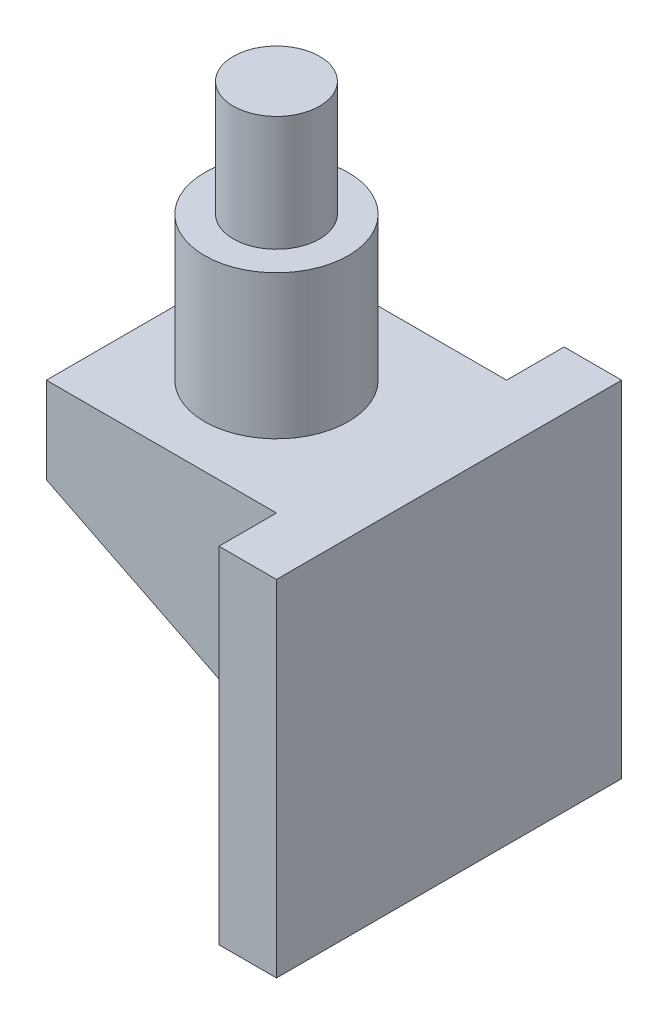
ISO-10303-21;
HEADER;
FILE_DESCRIPTION(('STEP AP214'),'2;1');
FILE_NAME('part.step','',(''),(''),'','','');
FILE_SCHEMA(('AUTOMOTIVE_DESIGN { 1 0 10303 214 1 1 1 1 }'));
ENDSEC;
DATA;
#1=APPLICATION_CONTEXT('core data for automotive mechanical design processes');
#2=APPLICATION_PROTOCOL_DEFINITION('international standard','automotive_design',2000,#1);
#3=PRODUCT_CONTEXT('',#1,'mechanical');
#4=PRODUCT('Part','Part','',(#3));
#5=PRODUCT_RELATED_PRODUCT_CATEGORY('part','',(#4));
#6=PRODUCT_DEFINITION_FORMATION('','',#4);
#7=PRODUCT_DEFINITION_CONTEXT('part definition',#1,'design');
#8=PRODUCT_DEFINITION('design','',#6,#7);
#9=PRODUCT_DEFINITION_SHAPE('','',#8);
#10=(LENGTH_UNIT() NAMED_UNIT(*) SI_UNIT(.MILLI.,.METRE.));
#11=(NAMED_UNIT(*) PLANE_ANGLE_UNIT() SI_UNIT($,.RADIAN.));
#12=(NAMED_UNIT(*) SI_UNIT($,.STERADIAN.) SOLID_ANGLE_UNIT());
#13=UNCERTAINTY_MEASURE_WITH_UNIT(LENGTH_MEASURE(1.E-05),#10,'distance_accuracy_value','');
#14=(GEOMETRIC_REPRESENTATION_CONTEXT(3) GLOBAL_UNCERTAINTY_ASSIGNED_CONTEXT((#13)) GLOBAL_UNIT_ASSIGNED_CONTEXT((#10,
#11,#12)) REPRESENTATION_CONTEXT('',''));
#15=CARTESIAN_POINT('',(0.,0.,0.));
#16=DIRECTION('',(0.,0.,1.));
#17=DIRECTION('',(1.,0.,0.));
#18=AXIS2_PLACEMENT_3D('',#15,#16,#17);
#19=CARTESIAN_POINT('',(-20.,105.,0.));
#20=DIRECTION('',(0.,-1.,0.));
#21=DIRECTION('',(0.,0.,-1.));
#22=AXIS2_PLACEMENT_3D('',#19,#20,#21);
#23=CYLINDRICAL_SURFACE('',#22,7.5);
#24=CARTESIAN_POINT('',(-20.,105.,0.));
#25=DIRECTION('',(0.,1.,0.));
#26=DIRECTION('',(0.,0.,1.));
#27=AXIS2_PLACEMENT_3D('',#24,#25,#26);
#28=CIRCLE('',#27,7.5);
#29=CARTESIAN_POINT('',(-20.,105.,7.5));
#30=VERTEX_POINT('',#29);
#31=EDGE_CURVE('E311',#30,#30,#28,.T.);
#32=ORIENTED_EDGE('',*,*,#31,.F.);
#33=EDGE_LOOP('',(#32));
#34=FACE_BOUND('',#33,.T.);
#35=CARTESIAN_POINT('',(-20.,85.,0.));
#36=DIRECTION('',(0.,1.,0.));
#37=DIRECTION('',(0.,0.,1.));
#38=AXIS2_PLACEMENT_3D('',#35,#36,#37);
#39=CIRCLE('',#38,7.5);
#40=CARTESIAN_POINT('',(-20.,85.,7.5));
#41=VERTEX_POINT('',#40);
#42=EDGE_CURVE('E9',#41,#41,#39,.T.);
#43=ORIENTED_EDGE('',*,*,#42,.T.);
#44=EDGE_LOOP('',(#43));
#45=FACE_BOUND('',#44,.T.);
#46=ADVANCED_FACE('F14',(#34,#45),#23,.T.);
#47=CARTESIAN_POINT('',(-20.,105.,0.));
#48=DIRECTION('',(0.,1.,0.));
#49=DIRECTION('',(0.,0.,1.));
#50=AXIS2_PLACEMENT_3D('',#47,#48,#49);
#51=PLANE('',#50);
#52=ORIENTED_EDGE('',*,*,#31,.T.);
#53=EDGE_LOOP('',(#52));
#54=FACE_BOUND('',#53,.T.);
#55=ADVANCED_FACE('F182',(#54),#51,.T.);
#56=CARTESIAN_POINT('',(-20.,85.,0.));
#57=DIRECTION('',(0.,-1.,0.));
#58=DIRECTION('',(0.,0.,-1.));
#59=AXIS2_PLACEMENT_3D('',#56,#57,#58);
#60=CYLINDRICAL_SURFACE('',#59,12.5);
#61=CARTESIAN_POINT('',(-20.,85.,0.));
#62=DIRECTION('',(0.,1.,0.));
#63=DIRECTION('',(0.,0.,1.));
#64=AXIS2_PLACEMENT_3D('',#61,#62,#63);
#65=CIRCLE('',#64,12.5);
#66=CARTESIAN_POINT('',(-20.,85.,12.5));
#67=VERTEX_POINT('',#66);
#68=EDGE_CURVE('E95',#67,#67,#65,.T.);
#69=ORIENTED_EDGE('',*,*,#68,.F.);
#70=EDGE_LOOP('',(#69));
#71=FACE_BOUND('',#70,.T.);
#72=CARTESIAN_POINT('',(-20.,60.0000000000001,0.));
#73=DIRECTION('',(0.,1.,0.));
#74=DIRECTION('',(0.,0.,1.));
#75=AXIS2_PLACEMENT_3D('',#72,#73,#74);
#76=CIRCLE('',#75,12.5);
#77=CARTESIAN_POINT('',(-20.,60.0000000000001,12.5));
#78=VERTEX_POINT('',#77);
#79=EDGE_CURVE('E23',#78,#78,#76,.T.);
#80=ORIENTED_EDGE('',*,*,#79,.T.);
#81=EDGE_LOOP('',(#80));
#82=FACE_BOUND('',#81,.T.);
#83=ADVANCED_FACE('F184',(#71,#82),#60,.T.);
#84=CARTESIAN_POINT('',(-20.,85.,0.));
#85=DIRECTION('',(0.,1.,0.));
#86=DIRECTION('',(0.,0.,1.));
#87=AXIS2_PLACEMENT_3D('',#84,#85,#86);
#88=PLANE('',#87);
#89=ORIENTED_EDGE('',*,*,#42,.F.);
#90=EDGE_LOOP('',(#89));
#91=FACE_BOUND('',#90,.T.);
#92=ORIENTED_EDGE('',*,*,#68,.T.);
#93=EDGE_LOOP('',(#92));
#94=FACE_BOUND('',#93,.T.);
#95=ADVANCED_FACE('F191',(#91,#94),#88,.T.);
#96=CARTESIAN_POINT('',(10.,60.0000000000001,29.9999999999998));
#97=DIRECTION('',(0.,-1.,0.));
#98=DIRECTION('',(0.,0.,-1.));
#99=AXIS2_PLACEMENT_3D('',#96,#97,#98);
#100=PLANE('',#99);
#101=DIRECTION('',(-1.,0.,0.));
#102=VECTOR('',#101,1.);
#103=CARTESIAN_POINT('',(10.,60.0000000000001,29.9999999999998));
#104=LINE('',#103,#102);
#105=CARTESIAN_POINT('',(10.,60.0000000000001,29.9999999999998));
#106=VERTEX_POINT('',#105);
#107=CARTESIAN_POINT('',(0.,60.0000000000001,29.9999999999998));
#108=VERTEX_POINT('',#107);
#109=EDGE_CURVE('E137',#106,#108,#104,.T.);
#110=ORIENTED_EDGE('',*,*,#109,.F.);
#111=DIRECTION('',(0.,0.,-1.));
#112=VECTOR('',#111,1.);
#113=CARTESIAN_POINT('',(10.,60.0000000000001,29.9999999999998));
#114=LINE('',#113,#112);
#115=CARTESIAN_POINT('',(10.,60.0000000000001,-29.9999999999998));
#116=VERTEX_POINT('',#115);
#117=EDGE_CURVE('E149',#106,#116,#114,.T.);
#118=ORIENTED_EDGE('',*,*,#117,.T.);
#119=DIRECTION('',(-1.,0.,0.));
#120=VECTOR('',#119,1.);
#121=CARTESIAN_POINT('',(10.,60.0000000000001,-29.9999999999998));
#122=LINE('',#121,#120);
#123=CARTESIAN_POINT('',(0.,60.0000000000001,-29.9999999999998));
#124=VERTEX_POINT('',#123);
#125=EDGE_CURVE('E125',#116,#124,#122,.T.);
#126=ORIENTED_EDGE('',*,*,#125,.T.);
#127=DIRECTION('',(0.,0.,-1.));
#128=VECTOR('',#127,1.);
#129=CARTESIAN_POINT('',(0.,60.0000000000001,29.9999999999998));
#130=LINE('',#129,#128);
#131=CARTESIAN_POINT('',(0.,60.0000000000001,-20.));
#132=VERTEX_POINT('',#131);
#133=EDGE_CURVE('E146',#132,#124,#130,.T.);
#134=ORIENTED_EDGE('',*,*,#133,.F.);
#135=DIRECTION('',(-1.,0.,0.));
#136=VECTOR('',#135,1.);
#137=CARTESIAN_POINT('',(0.,60.0000000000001,-20.));
#138=LINE('',#137,#136);
#139=CARTESIAN_POINT('',(-39.9999999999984,60.0000000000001,-20.));
#140=VERTEX_POINT('',#139);
#141=EDGE_CURVE('E94',#132,#140,#138,.T.);
#142=ORIENTED_EDGE('',*,*,#141,.T.);
#143=DIRECTION('',(0.,0.,-1.));
#144=VECTOR('',#143,1.);
#145=CARTESIAN_POINT('',(-40.,60.0000000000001,20.));
#146=LINE('',#145,#144);
#147=CARTESIAN_POINT('',(-40.,60.0000000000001,20.));
#148=VERTEX_POINT('',#147);
#149=EDGE_CURVE('E120',#148,#140,#146,.T.);
#150=ORIENTED_EDGE('',*,*,#149,.F.);
#151=DIRECTION('',(-1.,0.,0.));
#152=VECTOR('',#151,1.);
#153=CARTESIAN_POINT('',(0.,60.0000000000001,20.));
#154=LINE('',#153,#152);
#155=CARTESIAN_POINT('',(0.,60.0000000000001,20.));
#156=VERTEX_POINT('',#155);
#157=EDGE_CURVE('E84',#156,#148,#154,.T.);
#158=ORIENTED_EDGE('',*,*,#157,.F.);
#159=EDGE_CURVE('E154',#108,#156,#130,.T.);
#160=ORIENTED_EDGE('',*,*,#159,.F.);
#161=EDGE_LOOP('',(#110,#118,#126,#134,#142,#150,#158,#160));
#162=FACE_BOUND('',#161,.T.);
#163=ORIENTED_EDGE('',*,*,#79,.F.);
#164=EDGE_LOOP('',(#163));
#165=FACE_BOUND('',#164,.T.);
#166=ADVANCED_FACE('F163',(#162,#165),#100,.F.);
#167=CARTESIAN_POINT('',(0.,0.,29.9999999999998));
#168=DIRECTION('',(-1.,0.,0.));
#169=DIRECTION('',(0.,0.,1.));
#170=AXIS2_PLACEMENT_3D('',#167,#168,#169);
#171=PLANE('',#170);
#172=ORIENTED_EDGE('',*,*,#159,.T.);
#173=DIRECTION('',(0.,-1.,0.));
#174=VECTOR('',#173,1.);
#175=CARTESIAN_POINT('',(0.,60.0000000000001,20.));
#176=LINE('',#175,#174);
#177=CARTESIAN_POINT('',(0.,24.9999999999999,20.));
#178=VERTEX_POINT('',#177);
#179=EDGE_CURVE('E31',#156,#178,#176,.T.);
#180=ORIENTED_EDGE('',*,*,#179,.T.);
#181=DIRECTION('',(0.,0.,-1.));
#182=VECTOR('',#181,1.);
#183=CARTESIAN_POINT('',(0.,24.9999999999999,20.));
#184=LINE('',#183,#182);
#185=CARTESIAN_POINT('',(0.,24.9999999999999,-20.));
#186=VERTEX_POINT('',#185);
#187=EDGE_CURVE('E77',#178,#186,#184,.T.);
#188=ORIENTED_EDGE('',*,*,#187,.T.);
#189=DIRECTION('',(0.,-1.,0.));
#190=VECTOR('',#189,1.);
#191=CARTESIAN_POINT('',(0.,60.0000000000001,-20.));
#192=LINE('',#191,#190);
#193=EDGE_CURVE('E37',#132,#186,#192,.T.);
#194=ORIENTED_EDGE('',*,*,#193,.F.);
#195=ORIENTED_EDGE('',*,*,#133,.T.);
#196=DIRECTION('',(0.,1.,0.));
#197=VECTOR('',#196,1.);
#198=CARTESIAN_POINT('',(0.,0.,-29.9999999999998));
#199=LINE('',#198,#197);
#200=CARTESIAN_POINT('',(0.,0.,-29.9999999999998));
#201=VERTEX_POINT('',#200);
#202=EDGE_CURVE('E122',#201,#124,#199,.T.);
#203=ORIENTED_EDGE('',*,*,#202,.F.);
#204=DIRECTION('',(0.,0.,-1.));
#205=VECTOR('',#204,1.);
#206=CARTESIAN_POINT('',(0.,0.,29.9999999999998));
#207=LINE('',#206,#205);
#208=CARTESIAN_POINT('',(0.,0.,29.9999999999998));
#209=VERTEX_POINT('',#208);
#210=EDGE_CURVE('E156',#209,#201,#207,.T.);
#211=ORIENTED_EDGE('',*,*,#210,.F.);
#212=DIRECTION('',(0.,1.,0.));
#213=VECTOR('',#212,1.);
#214=CARTESIAN_POINT('',(0.,0.,29.9999999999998));
#215=LINE('',#214,#213);
#216=EDGE_CURVE('E134',#209,#108,#215,.T.);
#217=ORIENTED_EDGE('',*,*,#216,.T.);
#218=EDGE_LOOP('',(#172,#180,#188,#194,#195,#203,#211,#217));
#219=FACE_BOUND('',#218,.T.);
#220=ADVANCED_FACE('F78',(#219),#171,.T.);
#221=CARTESIAN_POINT('',(0.,0.,29.9999999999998));
#222=DIRECTION('',(0.,1.,0.));
#223=DIRECTION('',(0.,0.,1.));
#224=AXIS2_PLACEMENT_3D('',#221,#222,#223);
#225=PLANE('',#224);
#226=DIRECTION('',(0.,0.,-1.));
#227=VECTOR('',#226,1.);
#228=CARTESIAN_POINT('',(10.,0.,29.9999999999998));
#229=LINE('',#228,#227);
#230=CARTESIAN_POINT('',(10.,0.,29.9999999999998));
#231=VERTEX_POINT('',#230);
#232=CARTESIAN_POINT('',(9.99999999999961,0.,-29.9999999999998));
#233=VERTEX_POINT('',#232);
#234=EDGE_CURVE('E157',#231,#233,#229,.T.);
#235=ORIENTED_EDGE('',*,*,#234,.F.);
#236=DIRECTION('',(1.,0.,0.));
#237=VECTOR('',#236,1.);
#238=CARTESIAN_POINT('',(0.,0.,29.9999999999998));
#239=LINE('',#238,#237);
#240=EDGE_CURVE('E143',#209,#231,#239,.T.);
#241=ORIENTED_EDGE('',*,*,#240,.F.);
#242=ORIENTED_EDGE('',*,*,#210,.T.);
#243=DIRECTION('',(1.,0.,0.));
#244=VECTOR('',#243,1.);
#245=CARTESIAN_POINT('',(0.,0.,-29.9999999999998));
#246=LINE('',#245,#244);
#247=EDGE_CURVE('E131',#201,#233,#246,.T.);
#248=ORIENTED_EDGE('',*,*,#247,.T.);
#249=EDGE_LOOP('',(#235,#241,#242,#248));
#250=FACE_BOUND('',#249,.T.);
#251=ADVANCED_FACE('F16',(#250),#225,.F.);
#252=CARTESIAN_POINT('',(10.,60.0000000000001,29.9999999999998));
#253=DIRECTION('',(1.,0.,0.));
#254=DIRECTION('',(0.,1.,0.));
#255=AXIS2_PLACEMENT_3D('',#252,#253,#254);
#256=PLANE('',#255);
#257=ORIENTED_EDGE('',*,*,#117,.F.);
#258=DIRECTION('',(0.,-1.,0.));
#259=VECTOR('',#258,1.);
#260=CARTESIAN_POINT('',(10.,60.0000000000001,29.9999999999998));
#261=LINE('',#260,#259);
#262=EDGE_CURVE('E140',#106,#231,#261,.T.);
#263=ORIENTED_EDGE('',*,*,#262,.T.);
#264=ORIENTED_EDGE('',*,*,#234,.T.);
#265=DIRECTION('',(0.,-1.,0.));
#266=VECTOR('',#265,1.);
#267=CARTESIAN_POINT('',(10.,60.0000000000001,-29.9999999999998));
#268=LINE('',#267,#266);
#269=EDGE_CURVE('E128',#116,#233,#268,.T.);
#270=ORIENTED_EDGE('',*,*,#269,.F.);
#271=EDGE_LOOP('',(#257,#263,#264,#270));
#272=FACE_BOUND('',#271,.T.);
#273=ADVANCED_FACE('F170',(#272),#256,.T.);
#274=CARTESIAN_POINT('',(0.,60.0000000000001,29.9999999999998));
#275=DIRECTION('',(0.,0.,1.));
#276=DIRECTION('',(1.,0.,0.));
#277=AXIS2_PLACEMENT_3D('',#274,#275,#276);
#278=PLANE('',#277);
#279=ORIENTED_EDGE('',*,*,#216,.F.);
#280=ORIENTED_EDGE('',*,*,#240,.T.);
#281=ORIENTED_EDGE('',*,*,#262,.F.);
#282=ORIENTED_EDGE('',*,*,#109,.T.);
#283=EDGE_LOOP('',(#279,#280,#281,#282));
#284=FACE_BOUND('',#283,.T.);
#285=ADVANCED_FACE('F172',(#284),#278,.T.);
#286=CARTESIAN_POINT('',(0.,60.0000000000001,-29.9999999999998));
#287=DIRECTION('',(0.,0.,1.));
#288=DIRECTION('',(1.,0.,0.));
#289=AXIS2_PLACEMENT_3D('',#286,#287,#288);
#290=PLANE('',#289);
#291=ORIENTED_EDGE('',*,*,#202,.T.);
#292=ORIENTED_EDGE('',*,*,#125,.F.);
#293=ORIENTED_EDGE('',*,*,#269,.T.);
#294=ORIENTED_EDGE('',*,*,#247,.F.);
#295=EDGE_LOOP('',(#291,#292,#293,#294));
#296=FACE_BOUND('',#295,.T.);
#297=ADVANCED_FACE('F167',(#296),#290,.F.);
#298=CARTESIAN_POINT('',(-40.,60.0000000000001,20.));
#299=DIRECTION('',(1.,0.,0.));
#300=DIRECTION('',(0.,1.,0.));
#301=AXIS2_PLACEMENT_3D('',#298,#299,#300);
#302=PLANE('',#301);
#303=DIRECTION('',(0.,0.,-1.));
#304=VECTOR('',#303,1.);
#305=CARTESIAN_POINT('',(-39.9999999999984,44.9999999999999,20.));
#306=LINE('',#305,#304);
#307=CARTESIAN_POINT('',(-39.9999999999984,44.9999999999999,20.));
#308=VERTEX_POINT('',#307);
#309=CARTESIAN_POINT('',(-39.9999999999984,44.9999999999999,-20.));
#310=VERTEX_POINT('',#309);
#311=EDGE_CURVE('E83',#308,#310,#306,.T.);
#312=ORIENTED_EDGE('',*,*,#311,.F.);
#313=DIRECTION('',(0.,-1.,0.));
#314=VECTOR('',#313,1.);
#315=CARTESIAN_POINT('',(-40.,60.0000000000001,20.));
#316=LINE('',#315,#314);
#317=EDGE_CURVE('E113',#148,#308,#316,.T.);
#318=ORIENTED_EDGE('',*,*,#317,.F.);
#319=ORIENTED_EDGE('',*,*,#149,.T.);
#320=DIRECTION('',(0.,-1.,0.));
#321=VECTOR('',#320,1.);
#322=CARTESIAN_POINT('',(-39.9999999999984,60.0000000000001,-20.));
#323=LINE('',#322,#321);
#324=EDGE_CURVE('E98',#140,#310,#323,.T.);
#325=ORIENTED_EDGE('',*,*,#324,.T.);
#326=EDGE_LOOP('',(#312,#318,#319,#325));
#327=FACE_BOUND('',#326,.T.);
#328=ADVANCED_FACE('F206',(#327),#302,.F.);
#329=CARTESIAN_POINT('',(0.,24.9999999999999,20.));
#330=DIRECTION('',(-0.447213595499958,-0.894427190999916,0.));
#331=DIRECTION('',(0.894427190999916,-0.447213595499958,0.));
#332=AXIS2_PLACEMENT_3D('',#329,#330,#331);
#333=PLANE('',#332);
#334=DIRECTION('',(-0.894427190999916,0.447213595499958,0.));
#335=VECTOR('',#334,1.);
#336=CARTESIAN_POINT('',(0.,24.9999999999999,20.));
#337=LINE('',#336,#335);
#338=EDGE_CURVE('E106',#178,#308,#337,.T.);
#339=ORIENTED_EDGE('',*,*,#338,.T.);
#340=ORIENTED_EDGE('',*,*,#311,.T.);
#341=DIRECTION('',(-0.894427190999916,0.447213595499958,0.));
#342=VECTOR('',#341,1.);
#343=CARTESIAN_POINT('',(0.,24.9999999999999,-20.));
#344=LINE('',#343,#342);
#345=EDGE_CURVE('E91',#186,#310,#344,.T.);
#346=ORIENTED_EDGE('',*,*,#345,.F.);
#347=ORIENTED_EDGE('',*,*,#187,.F.);
#348=EDGE_LOOP('',(#339,#340,#346,#347));
#349=FACE_BOUND('',#348,.T.);
#350=ADVANCED_FACE('F97',(#349),#333,.T.);
#351=CARTESIAN_POINT('',(0.,60.0000000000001,20.));
#352=DIRECTION('',(0.,0.,-1.));
#353=DIRECTION('',(-1.,0.,0.));
#354=AXIS2_PLACEMENT_3D('',#351,#352,#353);
#355=PLANE('',#354);
#356=ORIENTED_EDGE('',*,*,#179,.F.);
#357=ORIENTED_EDGE('',*,*,#157,.T.);
#358=ORIENTED_EDGE('',*,*,#317,.T.);
#359=ORIENTED_EDGE('',*,*,#338,.F.);
#360=EDGE_LOOP('',(#356,#357,#358,#359));
#361=FACE_BOUND('',#360,.T.);
#362=ADVANCED_FACE('F203',(#361),#355,.F.);
#363=CARTESIAN_POINT('',(0.,60.0000000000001,-20.));
#364=DIRECTION('',(0.,0.,-1.));
#365=DIRECTION('',(-1.,0.,0.));
#366=AXIS2_PLACEMENT_3D('',#363,#364,#365);
#367=PLANE('',#366);
#368=ORIENTED_EDGE('',*,*,#193,.T.);
#369=ORIENTED_EDGE('',*,*,#345,.T.);
#370=ORIENTED_EDGE('',*,*,#324,.F.);
#371=ORIENTED_EDGE('',*,*,#141,.F.);
#372=EDGE_LOOP('',(#368,#369,#370,#371));
#373=FACE_BOUND('',#372,.T.);
#374=ADVANCED_FACE('F89',(#373),#367,.T.);
#375=CLOSED_SHELL('',(#46,#55,#83,#95,#166,#220,#251,#273,#285,#297,#328,#350,#362,#374));
#376=MANIFOLD_SOLID_BREP('B1',#375);
#377=ADVANCED_BREP_SHAPE_REPRESENTATION('',(#18,#376),#14);
#378=SHAPE_DEFINITION_REPRESENTATION(#9,#377);
ENDSEC;
END-ISO-10303-21;
